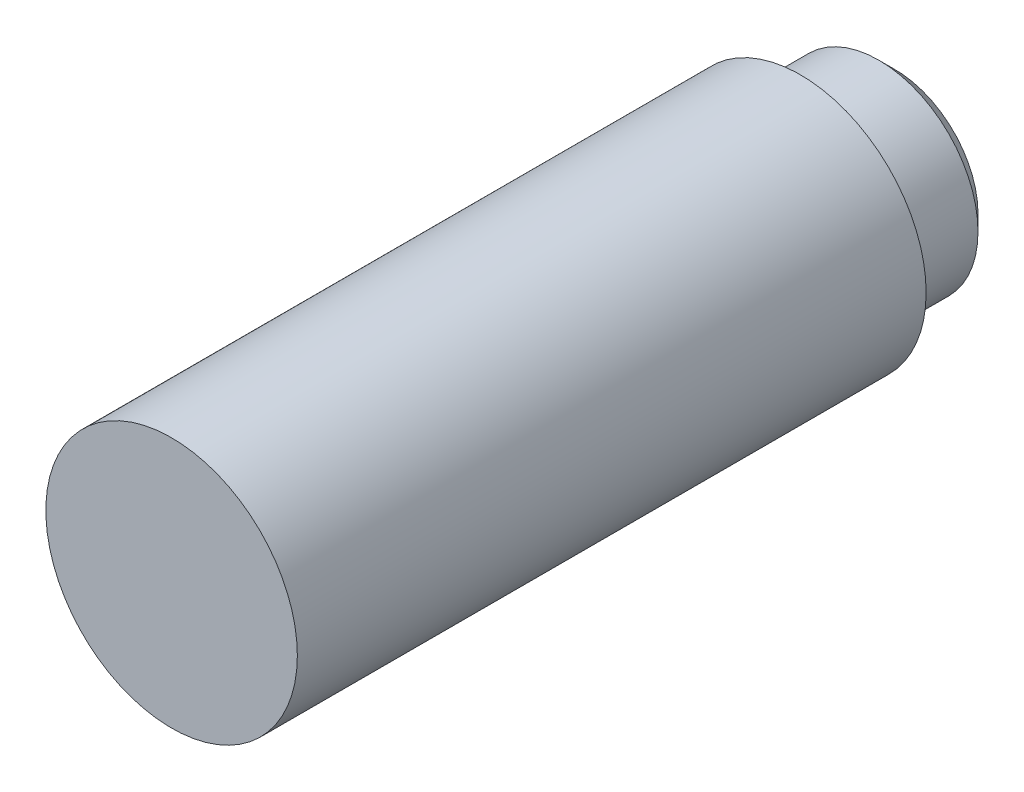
ISO-10303-21;
HEADER;
FILE_DESCRIPTION(('STEP AP214'),'2;1');
FILE_NAME('part.step','',(''),(''),'','','');
FILE_SCHEMA(('AUTOMOTIVE_DESIGN { 1 0 10303 214 1 1 1 1 }'));
ENDSEC;
DATA;
#1=APPLICATION_CONTEXT('core data for automotive mechanical design processes');
#2=APPLICATION_PROTOCOL_DEFINITION('international standard','automotive_design',2000,#1);
#3=PRODUCT_CONTEXT('',#1,'mechanical');
#4=PRODUCT('Part','Part','',(#3));
#5=PRODUCT_RELATED_PRODUCT_CATEGORY('part','',(#4));
#6=PRODUCT_DEFINITION_FORMATION('','',#4);
#7=PRODUCT_DEFINITION_CONTEXT('part definition',#1,'design');
#8=PRODUCT_DEFINITION('design','',#6,#7);
#9=PRODUCT_DEFINITION_SHAPE('','',#8);
#10=(LENGTH_UNIT() NAMED_UNIT(*) SI_UNIT(.MILLI.,.METRE.));
#11=(NAMED_UNIT(*) PLANE_ANGLE_UNIT() SI_UNIT($,.RADIAN.));
#12=(NAMED_UNIT(*) SI_UNIT($,.STERADIAN.) SOLID_ANGLE_UNIT());
#13=UNCERTAINTY_MEASURE_WITH_UNIT(LENGTH_MEASURE(1.E-05),#10,'distance_accuracy_value','');
#14=(GEOMETRIC_REPRESENTATION_CONTEXT(3) GLOBAL_UNCERTAINTY_ASSIGNED_CONTEXT((#13)) GLOBAL_UNIT_ASSIGNED_CONTEXT((#10,
#11,#12)) REPRESENTATION_CONTEXT('',''));
#15=CARTESIAN_POINT('',(0.,0.,0.));
#16=DIRECTION('',(0.,0.,1.));
#17=DIRECTION('',(1.,0.,0.));
#18=AXIS2_PLACEMENT_3D('',#15,#16,#17);
#19=CARTESIAN_POINT('',(0.,0.,3.));
#20=DIRECTION('',(0.,0.,-1.));
#21=DIRECTION('',(-1.,0.,0.));
#22=AXIS2_PLACEMENT_3D('',#19,#20,#21);
#23=CYLINDRICAL_SURFACE('',#22,3.15);
#24=CARTESIAN_POINT('',(0.,0.,0.500000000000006));
#25=DIRECTION('',(0.,0.,1.));
#26=DIRECTION('',(1.,0.,0.));
#27=AXIS2_PLACEMENT_3D('',#24,#25,#26);
#28=CIRCLE('',#27,3.15);
#29=CARTESIAN_POINT('',(3.15,0.,0.500000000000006));
#30=VERTEX_POINT('',#29);
#31=EDGE_CURVE('E45',#30,#30,#28,.T.);
#32=ORIENTED_EDGE('',*,*,#31,.T.);
#33=EDGE_LOOP('',(#32));
#34=FACE_BOUND('',#33,.T.);
#35=CARTESIAN_POINT('',(0.,0.,3.));
#36=DIRECTION('',(0.,0.,1.));
#37=DIRECTION('',(1.,0.,0.));
#38=AXIS2_PLACEMENT_3D('',#35,#36,#37);
#39=CIRCLE('',#38,3.15);
#40=CARTESIAN_POINT('',(3.15,0.,3.));
#41=VERTEX_POINT('',#40);
#42=EDGE_CURVE('E49',#41,#41,#39,.T.);
#43=ORIENTED_EDGE('',*,*,#42,.F.);
#44=EDGE_LOOP('',(#43));
#45=FACE_BOUND('',#44,.T.);
#46=ADVANCED_FACE('F37',(#34,#45),#23,.T.);
#47=CARTESIAN_POINT('',(0.,0.,0.));
#48=DIRECTION('',(0.,0.,1.));
#49=DIRECTION('',(1.,0.,0.));
#50=AXIS2_PLACEMENT_3D('',#47,#48,#49);
#51=PLANE('',#50);
#52=CARTESIAN_POINT('',(0.,0.,0.));
#53=DIRECTION('',(0.,0.,1.));
#54=DIRECTION('',(1.,0.,0.));
#55=AXIS2_PLACEMENT_3D('',#52,#53,#54);
#56=CIRCLE('',#55,2.64999999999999);
#57=CARTESIAN_POINT('',(2.64999999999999,0.,0.));
#58=VERTEX_POINT('',#57);
#59=EDGE_CURVE('E10',#58,#58,#56,.F.);
#60=ORIENTED_EDGE('',*,*,#59,.T.);
#61=EDGE_LOOP('',(#60));
#62=FACE_BOUND('',#61,.T.);
#63=ADVANCED_FACE('F67',(#62),#51,.F.);
#64=CARTESIAN_POINT('',(0.,0.,23.));
#65=DIRECTION('',(0.,0.,-1.));
#66=DIRECTION('',(-1.,0.,0.));
#67=AXIS2_PLACEMENT_3D('',#64,#65,#66);
#68=CYLINDRICAL_SURFACE('',#67,4.);
#69=CARTESIAN_POINT('',(0.,0.,23.));
#70=DIRECTION('',(0.,0.,1.));
#71=DIRECTION('',(1.,0.,0.));
#72=AXIS2_PLACEMENT_3D('',#69,#70,#71);
#73=CIRCLE('',#72,4.);
#74=CARTESIAN_POINT('',(4.,0.,23.));
#75=VERTEX_POINT('',#74);
#76=EDGE_CURVE('E53',#75,#75,#73,.T.);
#77=ORIENTED_EDGE('',*,*,#76,.F.);
#78=EDGE_LOOP('',(#77));
#79=FACE_BOUND('',#78,.T.);
#80=CARTESIAN_POINT('',(0.,0.,3.));
#81=DIRECTION('',(0.,0.,1.));
#82=DIRECTION('',(1.,0.,0.));
#83=AXIS2_PLACEMENT_3D('',#80,#81,#82);
#84=CIRCLE('',#83,4.);
#85=CARTESIAN_POINT('',(4.,0.,3.));
#86=VERTEX_POINT('',#85);
#87=EDGE_CURVE('E56',#86,#86,#84,.T.);
#88=ORIENTED_EDGE('',*,*,#87,.T.);
#89=EDGE_LOOP('',(#88));
#90=FACE_BOUND('',#89,.T.);
#91=ADVANCED_FACE('F64',(#79,#90),#68,.T.);
#92=CARTESIAN_POINT('',(0.,0.,23.));
#93=DIRECTION('',(0.,0.,1.));
#94=DIRECTION('',(1.,0.,0.));
#95=AXIS2_PLACEMENT_3D('',#92,#93,#94);
#96=PLANE('',#95);
#97=ORIENTED_EDGE('',*,*,#76,.T.);
#98=EDGE_LOOP('',(#97));
#99=FACE_BOUND('',#98,.T.);
#100=ADVANCED_FACE('F62',(#99),#96,.T.);
#101=CARTESIAN_POINT('',(0.,0.,3.));
#102=DIRECTION('',(0.,0.,1.));
#103=DIRECTION('',(1.,0.,0.));
#104=AXIS2_PLACEMENT_3D('',#101,#102,#103);
#105=PLANE('',#104);
#106=ORIENTED_EDGE('',*,*,#42,.T.);
#107=EDGE_LOOP('',(#106));
#108=FACE_BOUND('',#107,.T.);
#109=ORIENTED_EDGE('',*,*,#87,.F.);
#110=EDGE_LOOP('',(#109));
#111=FACE_BOUND('',#110,.T.);
#112=ADVANCED_FACE('F71',(#108,#111),#105,.F.);
#113=CARTESIAN_POINT('',(0.,0.,0.500000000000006));
#114=DIRECTION('',(0.,0.,1.));
#115=DIRECTION('',(1.,0.,0.));
#116=AXIS2_PLACEMENT_3D('',#113,#114,#115);
#117=CONICAL_SURFACE('',#116,3.15,0.785398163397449);
#118=ORIENTED_EDGE('',*,*,#59,.F.);
#119=EDGE_LOOP('',(#118));
#120=FACE_BOUND('',#119,.T.);
#121=ORIENTED_EDGE('',*,*,#31,.F.);
#122=EDGE_LOOP('',(#121));
#123=FACE_BOUND('',#122,.T.);
#124=ADVANCED_FACE('F40',(#120,#123),#117,.T.);
#125=CLOSED_SHELL('',(#46,#63,#91,#100,#112,#124));
#126=MANIFOLD_SOLID_BREP('B2',#125);
#127=ADVANCED_BREP_SHAPE_REPRESENTATION('',(#18,#126),#14);
#128=SHAPE_DEFINITION_REPRESENTATION(#9,#127);
ENDSEC;
END-ISO-10303-21;
